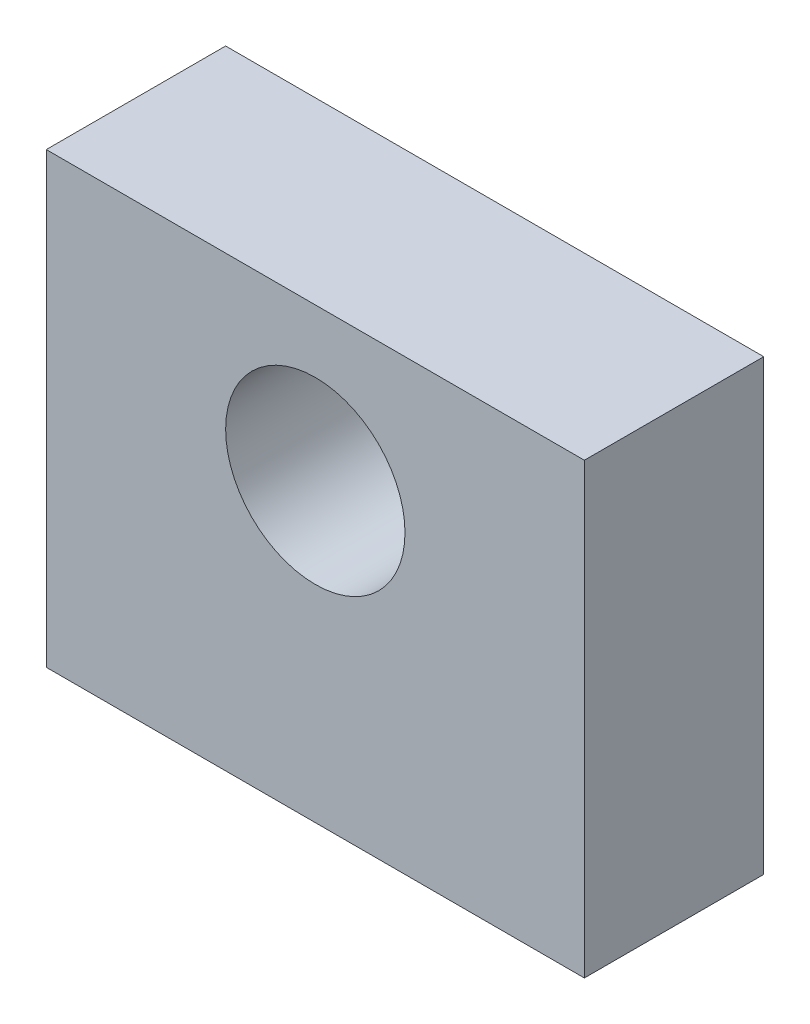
from build123d import *

# Parameters (mm, degrees)
ESQUISSE1_W             = 60
ESQUISSE1_H             = 20
EXTRUSION1_DEPTH        = 50
TROU_TARAUD_M81_D       = 6.8
TROU_TARAUD_M81_DEPTH   = 22.25
TROU_TARAUD_M81_TIP     = 2.042926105
ENL_V_MAT_EXTRU_1_REACH = 63.644
ESQUISSE4_R             = 10


with BuildPart() as part:
    # Esquisse1 → Extrusion1 (new body)
    with BuildSketch(Plane(origin=(0, 0, 0), x_dir=(1, 0, 0), z_dir=(0, 1, 0))):
        with Locations((0, 10)):
            Rectangle(ESQUISSE1_W, ESQUISSE1_H)
    extrude(amount=EXTRUSION1_DEPTH)

    # Trou taraud_ M81
    with Locations(Plane.XZ):
        with Locations((-18, -10), (18, -10)):
            Hole(TROU_TARAUD_M81_D / 2, depth=TROU_TARAUD_M81_DEPTH)
            with Locations((0, 0, -(TROU_TARAUD_M81_DEPTH + TROU_TARAUD_M81_TIP / 2))):  # 118° drill point
                Cone(0, TROU_TARAUD_M81_D / 2, TROU_TARAUD_M81_TIP, mode=Mode.SUBTRACT)

    # Esquisse4 → Enl_v. mat.-Extru.1 (cut, up to next)
    with BuildSketch(Plane(origin=(0, 0, -20), x_dir=(-1, 0, 0), z_dir=(0, 0, -1)), mode=Mode.PRIVATE) as enl_v_mat_extru_1_sk1:
        with Locations((0, 33)):
            Circle(ESQUISSE4_R)
    enl_v_mat_extru_1_tool1 = extrude(enl_v_mat_extru_1_sk1.sketch, amount=-ENL_V_MAT_EXTRU_1_REACH, mode=Mode.PRIVATE) & part.part
    add(enl_v_mat_extru_1_tool1.solids().sort_by_distance((0, 33, -20))[0], mode=Mode.SUBTRACT)


solid = part.part
